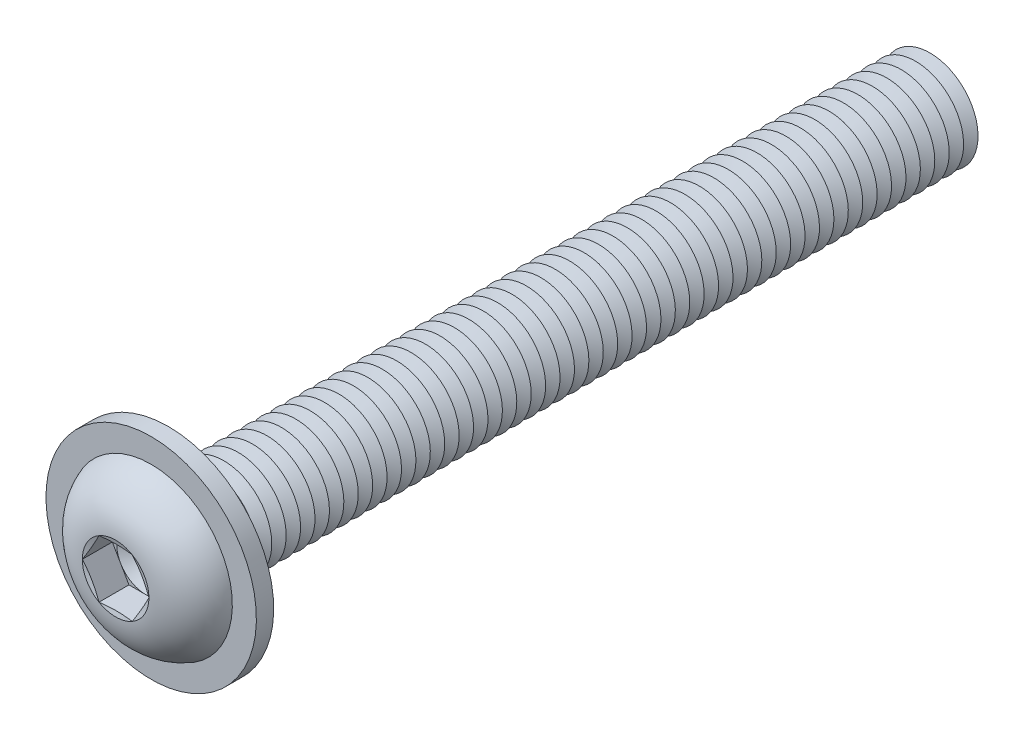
from build123d import *

# Parameters (mm, degrees)
FILLET1_R           = 0.75
LPATTERN1_COUNT     = 53
LPATTERN1_PITCH     = 1.5
CUT_EXTRUDE1_DEPTH  = 3.12
SKETCH5_R           = 10.95
SKETCH5_R_2         = 5.75
BOSS_EXTRUDE1_DEPTH = 1.8


with BuildPart() as part:
    # Sketch1 → Revolve1 (revolve)
    with BuildSketch(Plane(origin=(0, 0, 0), x_dir=(0, 0, -1), z_dir=(1, 0, 0))):
        with BuildLine():
            Line((0, 5), (0, 8.75))
            ThreePointArc((0, 8.75), (-3.814142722, 7.21429474), (-5.5, 3.4641))
            Line((-5.5, 3.4641), (-5.035898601, 1.73205))
            Line((-5.035898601, 1.73205), (-5.5, 1.73205))
            Line((-5.5, 1.73205), (-5.5, 0))
            Line((-5.5, 0), (80, 0))
            Line((80, 0), (80, 5))
            Line((80, 5), (0, 5))
        make_face()
    revolve(axis=Axis((0, 0, -80), (0, 0, 1)))

    # Fillet1
    fillet1_edges = [part.edges().sort_by_distance(p)[0] for p in [
        (0, -5, 0),
    ]]
    fillet(fillet1_edges, radius=FILLET1_R)

    # Sketch2 → Cut-Revolve1 (revolve, cut)
    with BuildSketch(Plane(origin=(0, 0, 0), x_dir=(0, 0, -1), z_dir=(1, 0, 0))):
        Polygon((79.25, 5), (80.75, 5), (80, 3.700961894), align=None)
    cut_revolve1 = revolve(axis=Axis((0, 0, -80), (0, 0, -1)), mode=Mode.SUBTRACT)

    # LPattern1: Cut-Revolve1 ×53
    with Locations(*[(0, 0, i * LPATTERN1_PITCH) for i in range(1, LPATTERN1_COUNT)]):
        add(cut_revolve1, mode=Mode.SUBTRACT)

    # Sketch3 → Cut-Extrude1 (cut)
    with BuildSketch(Plane.XY.offset(5.5)):
        Polygon((1.73205, 2.999998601), (-1.73205, 2.999998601), (-3.4641, 0), (-1.73205, -2.999998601), (1.73205, -2.999998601), (3.4641, 0), align=None)
    extrude(amount=-CUT_EXTRUDE1_DEPTH, mode=Mode.SUBTRACT)

    # Cut-Extrude2 cone 1 section (on through the dimple's axis) → Cut-Extrude2 (revolve, cut)
    with BuildSketch(Plane(origin=(0, 0, 2.38), x_dir=(0, -1, 0), z_dir=(1, 0, 0))):
        Polygon((0, 0), (2.999998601, 0), (0, 1.73205), align=None)
    revolve(axis=Axis((0, 0, 2.38), (0, 0, -1)), mode=Mode.SUBTRACT)

    # Sketch5 → Boss-Extrude1 (add)
    with BuildSketch(Plane(origin=(0, 0, 0), x_dir=(-1, 0, 0), z_dir=(0, 0, -1))):
        with Locations(Location((0, 0, 0), (0, 0, 90))):
            Circle(SKETCH5_R)
        Circle(SKETCH5_R_2, mode=Mode.SUBTRACT)
    extrude(amount=-BOSS_EXTRUDE1_DEPTH)


solid = part.part
